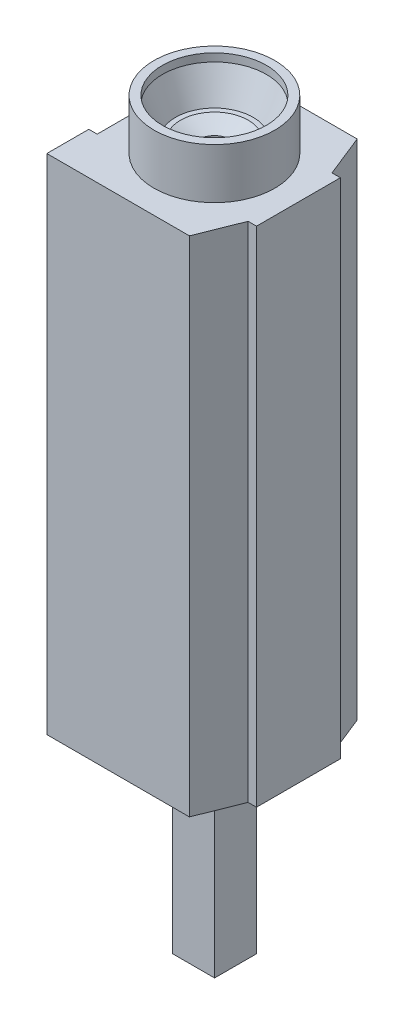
from build123d import *

# Parameters (mm, degrees)
BODY_1_DEPTH            = 7.62
CUT_1_DEPTH             = 7.62
SKETCH6_W               = 0.635
SKETCH6_H               = 0.635
CONTACT_TAIL_DEPTH      = 3.1242
CONTACT_TAIL_POINT_SIZE = 0.25


with BuildPart() as part:
    # Sketch1 → Body 1 (new body)
    with BuildSketch(Plane(origin=(0, 0, 0), x_dir=(1, 0, 0), z_dir=(0, 1, 0))):
        Polygon((-1.27, 1.27), (1.27, 1.27), (1.27, -1.27), (-1.27, -1.27), (-1.27, -0.635), (-1.143, -0.635), (-1.143, 0.635), (-1.27, 0.635), align=None)
    extrude(amount=BODY_1_DEPTH)

    # Sketch5 → Cut 1 (cut)
    with BuildSketch(Plane(origin=(0, 7.62, 0), x_dir=(1, 0, 0), z_dir=(0, 1, 0))):
        Polygon((0.889, 1.27), (1.651, 1.27), (1.397, 0.635), (1.143, 0.635), align=None)
        Polygon((1.143, -0.635), (0.889, -1.27), (1.651, -1.27), (1.397, -0.635), align=None)
    extrude(amount=-CUT_1_DEPTH, mode=Mode.SUBTRACT)

    # Sketch3 → Contact Top (revolve)
    with BuildSketch(Plane(origin=(-0.00254, 0, 0), x_dir=(0, 0, -1), z_dir=(1, 0, 0))):
        Polygon((-0.7874, 8.382), (-0.9144, 8.382), (-0.9144, 7.619450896), (-0.913382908, 7.62), (-0.23991189, 7.62), (-0.23991189, 7.684152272), (-0.512312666, 7.799946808), (-0.587346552, 7.799946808), (-0.7874, 8.262468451), align=None)
    revolve(axis=Axis((-0.00254, 0.337825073, 0), (0, -1, 0)))

    # Sketch6 → Contact Tail (add)
    with BuildSketch(Plane.XZ):
        Rectangle(SKETCH6_W, SKETCH6_H)
    extrude(amount=CONTACT_TAIL_DEPTH)

    # Contact Tail Point
    contact_tail_point_edges = [part.edges().sort_by_distance(p)[0] for p in [
        (-0.3175, -3.1242, 0),
        (0, -3.1242, -0.3175),
        (0.3175, -3.1242, 0),
        (0, -3.1242, 0.3175),
    ]]
    chamfer(contact_tail_point_edges, length=CONTACT_TAIL_POINT_SIZE)


solid = part.part
